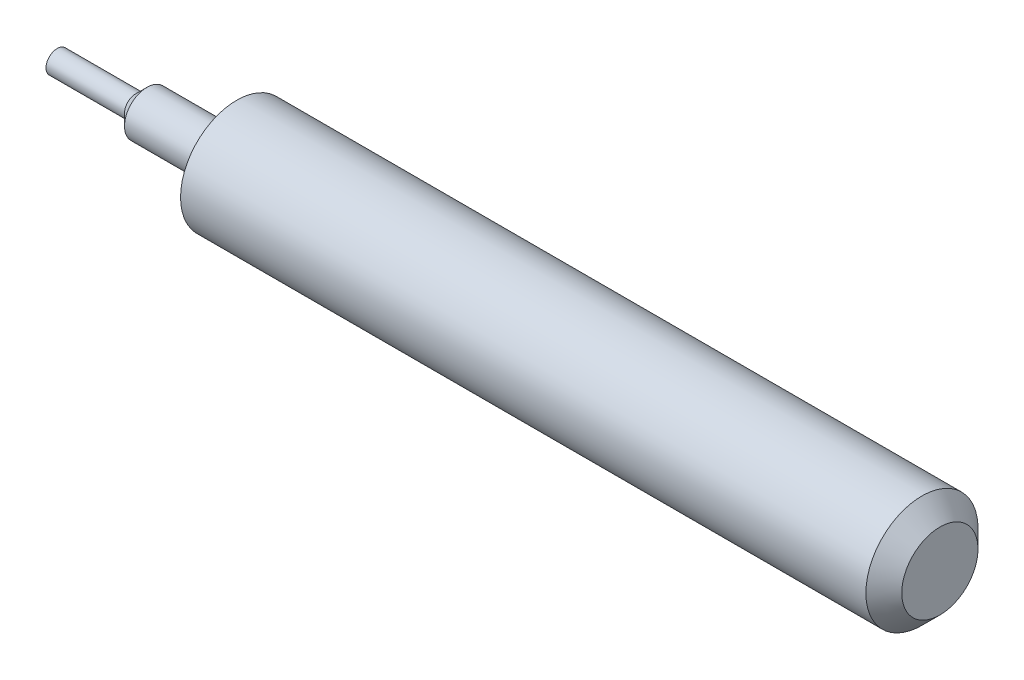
ISO-10303-21;
HEADER;
FILE_DESCRIPTION(('STEP AP214'),'2;1');
FILE_NAME('part.step','',(''),(''),'','','');
FILE_SCHEMA(('AUTOMOTIVE_DESIGN { 1 0 10303 214 1 1 1 1 }'));
ENDSEC;
DATA;
#1=APPLICATION_CONTEXT('core data for automotive mechanical design processes');
#2=APPLICATION_PROTOCOL_DEFINITION('international standard','automotive_design',2000,#1);
#3=PRODUCT_CONTEXT('',#1,'mechanical');
#4=PRODUCT('Part','Part','',(#3));
#5=PRODUCT_RELATED_PRODUCT_CATEGORY('part','',(#4));
#6=PRODUCT_DEFINITION_FORMATION('','',#4);
#7=PRODUCT_DEFINITION_CONTEXT('part definition',#1,'design');
#8=PRODUCT_DEFINITION('design','',#6,#7);
#9=PRODUCT_DEFINITION_SHAPE('','',#8);
#10=(LENGTH_UNIT() NAMED_UNIT(*) SI_UNIT(.MILLI.,.METRE.));
#11=(NAMED_UNIT(*) PLANE_ANGLE_UNIT() SI_UNIT($,.RADIAN.));
#12=(NAMED_UNIT(*) SI_UNIT($,.STERADIAN.) SOLID_ANGLE_UNIT());
#13=UNCERTAINTY_MEASURE_WITH_UNIT(LENGTH_MEASURE(1.E-05),#10,'distance_accuracy_value','');
#14=(GEOMETRIC_REPRESENTATION_CONTEXT(3) GLOBAL_UNCERTAINTY_ASSIGNED_CONTEXT((#13)) GLOBAL_UNIT_ASSIGNED_CONTEXT((#10,
#11,#12)) REPRESENTATION_CONTEXT('',''));
#15=CARTESIAN_POINT('',(0.,0.,0.));
#16=DIRECTION('',(0.,0.,1.));
#17=DIRECTION('',(1.,0.,0.));
#18=AXIS2_PLACEMENT_3D('',#15,#16,#17);
#19=CARTESIAN_POINT('',(-25.4,0.,0.));
#20=DIRECTION('',(1.,0.,0.));
#21=DIRECTION('',(0.,0.,-1.));
#22=AXIS2_PLACEMENT_3D('',#19,#20,#21);
#23=PLANE('',#22);
#24=CARTESIAN_POINT('',(-25.4,0.,0.));
#25=DIRECTION('',(-1.,0.,0.));
#26=DIRECTION('',(0.,0.,1.));
#27=AXIS2_PLACEMENT_3D('',#24,#25,#26);
#28=CIRCLE('',#27,1.5875);
#29=CARTESIAN_POINT('',(-25.4,0.,1.5875));
#30=VERTEX_POINT('',#29);
#31=EDGE_CURVE('E55',#30,#30,#28,.T.);
#32=ORIENTED_EDGE('',*,*,#31,.T.);
#33=EDGE_LOOP('',(#32));
#34=FACE_BOUND('',#33,.T.);
#35=ADVANCED_FACE('F43',(#34),#23,.F.);
#36=CARTESIAN_POINT('',(-1000.,0.,0.));
#37=DIRECTION('',(-1.,0.,0.));
#38=DIRECTION('',(0.,0.,1.));
#39=AXIS2_PLACEMENT_3D('',#36,#37,#38);
#40=CYLINDRICAL_SURFACE('',#39,1.5875);
#41=ORIENTED_EDGE('',*,*,#31,.F.);
#42=EDGE_LOOP('',(#41));
#43=FACE_BOUND('',#42,.T.);
#44=CARTESIAN_POINT('',(-14.2875,0.,0.));
#45=DIRECTION('',(-1.,0.,0.));
#46=DIRECTION('',(0.,0.,1.));
#47=AXIS2_PLACEMENT_3D('',#44,#45,#46);
#48=CIRCLE('',#47,1.5875);
#49=CARTESIAN_POINT('',(-14.2875,0.,1.5875));
#50=VERTEX_POINT('',#49);
#51=EDGE_CURVE('E59',#50,#50,#48,.T.);
#52=ORIENTED_EDGE('',*,*,#51,.T.);
#53=EDGE_LOOP('',(#52));
#54=FACE_BOUND('',#53,.T.);
#55=ADVANCED_FACE('F89',(#43,#54),#40,.T.);
#56=CARTESIAN_POINT('',(-12.7,0.,0.));
#57=DIRECTION('',(1.,0.,0.));
#58=DIRECTION('',(0.,0.,-1.));
#59=AXIS2_PLACEMENT_3D('',#56,#57,#58);
#60=CONICAL_SURFACE('',#59,3.175,0.78539816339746);
#61=ORIENTED_EDGE('',*,*,#51,.F.);
#62=EDGE_LOOP('',(#61));
#63=FACE_BOUND('',#62,.T.);
#64=CARTESIAN_POINT('',(-12.7,0.,0.));
#65=DIRECTION('',(-1.,0.,0.));
#66=DIRECTION('',(0.,0.,1.));
#67=AXIS2_PLACEMENT_3D('',#64,#65,#66);
#68=CIRCLE('',#67,3.175);
#69=CARTESIAN_POINT('',(-12.7,0.,3.175));
#70=VERTEX_POINT('',#69);
#71=EDGE_CURVE('E64',#70,#70,#68,.T.);
#72=ORIENTED_EDGE('',*,*,#71,.T.);
#73=EDGE_LOOP('',(#72));
#74=FACE_BOUND('',#73,.T.);
#75=ADVANCED_FACE('F94',(#63,#74),#60,.T.);
#76=CARTESIAN_POINT('',(-1000.,0.,0.));
#77=DIRECTION('',(-1.,0.,0.));
#78=DIRECTION('',(0.,0.,1.));
#79=AXIS2_PLACEMENT_3D('',#76,#77,#78);
#80=CYLINDRICAL_SURFACE('',#79,3.175);
#81=ORIENTED_EDGE('',*,*,#71,.F.);
#82=EDGE_LOOP('',(#81));
#83=FACE_BOUND('',#82,.T.);
#84=CARTESIAN_POINT('',(0.,0.,0.));
#85=DIRECTION('',(-1.,0.,0.));
#86=DIRECTION('',(0.,0.,1.));
#87=AXIS2_PLACEMENT_3D('',#84,#85,#86);
#88=CIRCLE('',#87,3.175);
#89=CARTESIAN_POINT('',(0.,0.,3.175));
#90=VERTEX_POINT('',#89);
#91=EDGE_CURVE('E67',#90,#90,#88,.T.);
#92=ORIENTED_EDGE('',*,*,#91,.T.);
#93=EDGE_LOOP('',(#92));
#94=FACE_BOUND('',#93,.T.);
#95=ADVANCED_FACE('F85',(#83,#94),#80,.T.);
#96=CARTESIAN_POINT('',(0.,0.,-3.175));
#97=DIRECTION('',(1.,0.,0.));
#98=DIRECTION('',(0.,0.,-1.));
#99=AXIS2_PLACEMENT_3D('',#96,#97,#98);
#100=PLANE('',#99);
#101=ORIENTED_EDGE('',*,*,#91,.F.);
#102=EDGE_LOOP('',(#101));
#103=FACE_BOUND('',#102,.T.);
#104=CARTESIAN_POINT('',(0.,0.,0.));
#105=DIRECTION('',(-1.,0.,0.));
#106=DIRECTION('',(0.,0.,1.));
#107=AXIS2_PLACEMENT_3D('',#104,#105,#106);
#108=CIRCLE('',#107,7.9375);
#109=CARTESIAN_POINT('',(0.,0.,7.9375));
#110=VERTEX_POINT('',#109);
#111=EDGE_CURVE('E70',#110,#110,#108,.T.);
#112=ORIENTED_EDGE('',*,*,#111,.T.);
#113=EDGE_LOOP('',(#112));
#114=FACE_BOUND('',#113,.T.);
#115=ADVANCED_FACE('F74',(#103,#114),#100,.F.);
#116=CARTESIAN_POINT('',(-1000.,0.,0.));
#117=DIRECTION('',(-1.,0.,0.));
#118=DIRECTION('',(0.,0.,1.));
#119=AXIS2_PLACEMENT_3D('',#116,#117,#118);
#120=CYLINDRICAL_SURFACE('',#119,7.9375);
#121=CARTESIAN_POINT('',(97.0280000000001,0.,0.));
#122=DIRECTION('',(-1.,0.,0.));
#123=DIRECTION('',(0.,0.,1.));
#124=AXIS2_PLACEMENT_3D('',#121,#122,#123);
#125=CIRCLE('',#124,7.9375);
#126=CARTESIAN_POINT('',(97.0280000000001,0.,7.9375));
#127=VERTEX_POINT('',#126);
#128=EDGE_CURVE('E51',#127,#127,#125,.T.);
#129=ORIENTED_EDGE('',*,*,#128,.T.);
#130=EDGE_LOOP('',(#129));
#131=FACE_BOUND('',#130,.T.);
#132=ORIENTED_EDGE('',*,*,#111,.F.);
#133=EDGE_LOOP('',(#132));
#134=FACE_BOUND('',#133,.T.);
#135=ADVANCED_FACE('F76',(#131,#134),#120,.T.);
#136=CARTESIAN_POINT('',(99.568,0.,-7.9375));
#137=DIRECTION('',(-1.,0.,0.));
#138=DIRECTION('',(0.,0.,1.));
#139=AXIS2_PLACEMENT_3D('',#136,#137,#138);
#140=PLANE('',#139);
#141=CARTESIAN_POINT('',(99.568,0.,0.));
#142=DIRECTION('',(-1.,0.,0.));
#143=DIRECTION('',(0.,0.,1.));
#144=AXIS2_PLACEMENT_3D('',#141,#142,#143);
#145=CIRCLE('',#144,5.39750000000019);
#146=CARTESIAN_POINT('',(99.568,0.,5.39750000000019));
#147=VERTEX_POINT('',#146);
#148=EDGE_CURVE('E10',#147,#147,#145,.F.);
#149=ORIENTED_EDGE('',*,*,#148,.T.);
#150=EDGE_LOOP('',(#149));
#151=FACE_BOUND('',#150,.T.);
#152=ADVANCED_FACE('F78',(#151),#140,.F.);
#153=CARTESIAN_POINT('',(97.0280000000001,0.,0.));
#154=DIRECTION('',(-1.,0.,0.));
#155=DIRECTION('',(0.,0.,1.));
#156=AXIS2_PLACEMENT_3D('',#153,#154,#155);
#157=CONICAL_SURFACE('',#156,7.9375,0.785398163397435);
#158=ORIENTED_EDGE('',*,*,#148,.F.);
#159=EDGE_LOOP('',(#158));
#160=FACE_BOUND('',#159,.T.);
#161=ORIENTED_EDGE('',*,*,#128,.F.);
#162=EDGE_LOOP('',(#161));
#163=FACE_BOUND('',#162,.T.);
#164=ADVANCED_FACE('F46',(#160,#163),#157,.T.);
#165=CLOSED_SHELL('',(#35,#55,#75,#95,#115,#135,#152,#164));
#166=MANIFOLD_SOLID_BREP('B2',#165);
#167=ADVANCED_BREP_SHAPE_REPRESENTATION('',(#18,#166),#14);
#168=SHAPE_DEFINITION_REPRESENTATION(#9,#167);
ENDSEC;
END-ISO-10303-21;
